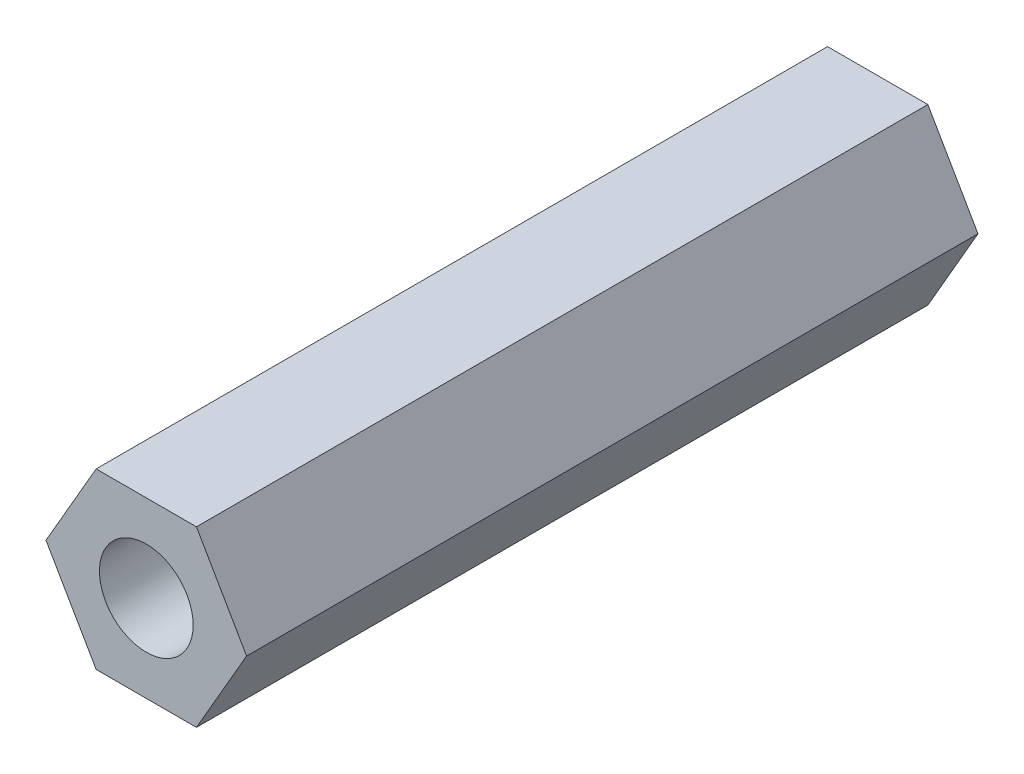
ISO-10303-21;
HEADER;
FILE_DESCRIPTION(('STEP AP214'),'2;1');
FILE_NAME('part.step','',(''),(''),'','','');
FILE_SCHEMA(('AUTOMOTIVE_DESIGN { 1 0 10303 214 1 1 1 1 }'));
ENDSEC;
DATA;
#1=APPLICATION_CONTEXT('core data for automotive mechanical design processes');
#2=APPLICATION_PROTOCOL_DEFINITION('international standard','automotive_design',2000,#1);
#3=PRODUCT_CONTEXT('',#1,'mechanical');
#4=PRODUCT('Part','Part','',(#3));
#5=PRODUCT_RELATED_PRODUCT_CATEGORY('part','',(#4));
#6=PRODUCT_DEFINITION_FORMATION('','',#4);
#7=PRODUCT_DEFINITION_CONTEXT('part definition',#1,'design');
#8=PRODUCT_DEFINITION('design','',#6,#7);
#9=PRODUCT_DEFINITION_SHAPE('','',#8);
#10=(LENGTH_UNIT() NAMED_UNIT(*) SI_UNIT(.MILLI.,.METRE.));
#11=(NAMED_UNIT(*) PLANE_ANGLE_UNIT() SI_UNIT($,.RADIAN.));
#12=(NAMED_UNIT(*) SI_UNIT($,.STERADIAN.) SOLID_ANGLE_UNIT());
#13=UNCERTAINTY_MEASURE_WITH_UNIT(LENGTH_MEASURE(1.E-05),#10,'distance_accuracy_value','');
#14=(GEOMETRIC_REPRESENTATION_CONTEXT(3) GLOBAL_UNCERTAINTY_ASSIGNED_CONTEXT((#13)) GLOBAL_UNIT_ASSIGNED_CONTEXT((#10,
#11,#12)) REPRESENTATION_CONTEXT('',''));
#15=CARTESIAN_POINT('',(0.,0.,0.));
#16=DIRECTION('',(0.,0.,1.));
#17=DIRECTION('',(1.,0.,0.));
#18=AXIS2_PLACEMENT_3D('',#15,#16,#17);
#19=CARTESIAN_POINT('',(-5.48482755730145,-9.49999999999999,80.));
#20=DIRECTION('',(0.,0.,-1.));
#21=DIRECTION('',(-1.,0.,0.));
#22=AXIS2_PLACEMENT_3D('',#19,#20,#21);
#23=PLANE('',#22);
#24=DIRECTION('',(1.,0.,0.));
#25=VECTOR('',#24,1.);
#26=CARTESIAN_POINT('',(-5.48482755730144,-9.49999999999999,80.));
#27=LINE('',#26,#25);
#28=CARTESIAN_POINT('',(-5.48482755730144,-9.49999999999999,80.));
#29=VERTEX_POINT('',#28);
#30=CARTESIAN_POINT('',(5.48482755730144,-9.49999999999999,80.));
#31=VERTEX_POINT('',#30);
#32=EDGE_CURVE('E112',#29,#31,#27,.T.);
#33=ORIENTED_EDGE('',*,*,#32,.T.);
#34=DIRECTION('',(0.5,0.866025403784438,0.));
#35=VECTOR('',#34,1.);
#36=CARTESIAN_POINT('',(5.48482755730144,-9.49999999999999,80.));
#37=LINE('',#36,#35);
#38=CARTESIAN_POINT('',(10.9696551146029,0.,80.));
#39=VERTEX_POINT('',#38);
#40=EDGE_CURVE('E93',#31,#39,#37,.T.);
#41=ORIENTED_EDGE('',*,*,#40,.T.);
#42=DIRECTION('',(-0.5,0.866025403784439,0.));
#43=VECTOR('',#42,1.);
#44=CARTESIAN_POINT('',(10.9696551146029,0.,80.));
#45=LINE('',#44,#43);
#46=CARTESIAN_POINT('',(5.48482755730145,9.49999999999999,80.));
#47=VERTEX_POINT('',#46);
#48=EDGE_CURVE('E115',#39,#47,#45,.T.);
#49=ORIENTED_EDGE('',*,*,#48,.T.);
#50=DIRECTION('',(-1.,0.,0.));
#51=VECTOR('',#50,1.);
#52=CARTESIAN_POINT('',(5.48482755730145,9.49999999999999,80.));
#53=LINE('',#52,#51);
#54=CARTESIAN_POINT('',(-5.48482755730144,9.49999999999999,80.));
#55=VERTEX_POINT('',#54);
#56=EDGE_CURVE('E117',#47,#55,#53,.T.);
#57=ORIENTED_EDGE('',*,*,#56,.T.);
#58=DIRECTION('',(-0.5,-0.866025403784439,0.));
#59=VECTOR('',#58,1.);
#60=CARTESIAN_POINT('',(-5.48482755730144,9.49999999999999,80.));
#61=LINE('',#60,#59);
#62=CARTESIAN_POINT('',(-10.9696551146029,0.,80.));
#63=VERTEX_POINT('',#62);
#64=EDGE_CURVE('E46',#55,#63,#61,.T.);
#65=ORIENTED_EDGE('',*,*,#64,.T.);
#66=DIRECTION('',(0.5,-0.866025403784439,0.));
#67=VECTOR('',#66,1.);
#68=CARTESIAN_POINT('',(-10.9696551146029,0.,80.));
#69=LINE('',#68,#67);
#70=EDGE_CURVE('E41',#63,#29,#69,.T.);
#71=ORIENTED_EDGE('',*,*,#70,.T.);
#72=EDGE_LOOP('',(#33,#41,#49,#57,#65,#71));
#73=FACE_BOUND('',#72,.T.);
#74=CARTESIAN_POINT('',(0.,0.,80.));
#75=DIRECTION('',(0.,0.,1.));
#76=DIRECTION('',(1.,0.,0.));
#77=AXIS2_PLACEMENT_3D('',#74,#75,#76);
#78=CIRCLE('',#77,5.125);
#79=CARTESIAN_POINT('',(5.125,0.,80.));
#80=VERTEX_POINT('',#79);
#81=EDGE_CURVE('E98',#80,#80,#78,.T.);
#82=ORIENTED_EDGE('',*,*,#81,.F.);
#83=EDGE_LOOP('',(#82));
#84=FACE_BOUND('',#83,.T.);
#85=ADVANCED_FACE('F26',(#73,#84),#23,.F.);
#86=CARTESIAN_POINT('',(-5.48482755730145,-9.49999999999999,0.));
#87=DIRECTION('',(0.,0.,-1.));
#88=DIRECTION('',(-1.,0.,0.));
#89=AXIS2_PLACEMENT_3D('',#86,#87,#88);
#90=PLANE('',#89);
#91=DIRECTION('',(1.,0.,0.));
#92=VECTOR('',#91,1.);
#93=CARTESIAN_POINT('',(-5.48482755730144,-9.49999999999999,0.));
#94=LINE('',#93,#92);
#95=CARTESIAN_POINT('',(-5.48482755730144,-9.49999999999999,0.));
#96=VERTEX_POINT('',#95);
#97=CARTESIAN_POINT('',(5.48482755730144,-9.49999999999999,0.));
#98=VERTEX_POINT('',#97);
#99=EDGE_CURVE('E84',#96,#98,#94,.T.);
#100=ORIENTED_EDGE('',*,*,#99,.F.);
#101=DIRECTION('',(0.5,-0.866025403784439,0.));
#102=VECTOR('',#101,1.);
#103=CARTESIAN_POINT('',(-10.9696551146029,0.,0.));
#104=LINE('',#103,#102);
#105=CARTESIAN_POINT('',(-10.9696551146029,0.,0.));
#106=VERTEX_POINT('',#105);
#107=EDGE_CURVE('E110',#106,#96,#104,.T.);
#108=ORIENTED_EDGE('',*,*,#107,.F.);
#109=DIRECTION('',(-0.5,-0.866025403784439,0.));
#110=VECTOR('',#109,1.);
#111=CARTESIAN_POINT('',(-5.48482755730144,9.49999999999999,0.));
#112=LINE('',#111,#110);
#113=CARTESIAN_POINT('',(-5.48482755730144,9.49999999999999,0.));
#114=VERTEX_POINT('',#113);
#115=EDGE_CURVE('E108',#114,#106,#112,.T.);
#116=ORIENTED_EDGE('',*,*,#115,.F.);
#117=DIRECTION('',(-1.,0.,0.));
#118=VECTOR('',#117,1.);
#119=CARTESIAN_POINT('',(5.48482755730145,9.49999999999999,0.));
#120=LINE('',#119,#118);
#121=CARTESIAN_POINT('',(5.48482755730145,9.49999999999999,0.));
#122=VERTEX_POINT('',#121);
#123=EDGE_CURVE('E106',#122,#114,#120,.T.);
#124=ORIENTED_EDGE('',*,*,#123,.F.);
#125=DIRECTION('',(-0.5,0.866025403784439,0.));
#126=VECTOR('',#125,1.);
#127=CARTESIAN_POINT('',(10.9696551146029,0.,0.));
#128=LINE('',#127,#126);
#129=CARTESIAN_POINT('',(10.9696551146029,0.,0.));
#130=VERTEX_POINT('',#129);
#131=EDGE_CURVE('E86',#130,#122,#128,.T.);
#132=ORIENTED_EDGE('',*,*,#131,.F.);
#133=DIRECTION('',(0.5,0.866025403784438,0.));
#134=VECTOR('',#133,1.);
#135=CARTESIAN_POINT('',(5.48482755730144,-9.49999999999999,0.));
#136=LINE('',#135,#134);
#137=EDGE_CURVE('E79',#98,#130,#136,.T.);
#138=ORIENTED_EDGE('',*,*,#137,.F.);
#139=EDGE_LOOP('',(#100,#108,#116,#124,#132,#138));
#140=FACE_BOUND('',#139,.T.);
#141=CARTESIAN_POINT('',(0.,0.,0.));
#142=DIRECTION('',(0.,0.,1.));
#143=DIRECTION('',(1.,0.,0.));
#144=AXIS2_PLACEMENT_3D('',#141,#142,#143);
#145=CIRCLE('',#144,5.125);
#146=CARTESIAN_POINT('',(5.125,0.,0.));
#147=VERTEX_POINT('',#146);
#148=EDGE_CURVE('E101',#147,#147,#145,.T.);
#149=ORIENTED_EDGE('',*,*,#148,.T.);
#150=EDGE_LOOP('',(#149));
#151=FACE_BOUND('',#150,.T.);
#152=ADVANCED_FACE('F80',(#140,#151),#90,.T.);
#153=CARTESIAN_POINT('',(-5.48482755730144,-9.49999999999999,80.));
#154=DIRECTION('',(0.,1.,0.));
#155=DIRECTION('',(0.,0.,1.));
#156=AXIS2_PLACEMENT_3D('',#153,#154,#155);
#157=PLANE('',#156);
#158=ORIENTED_EDGE('',*,*,#99,.T.);
#159=DIRECTION('',(0.,0.,-1.));
#160=VECTOR('',#159,1.);
#161=CARTESIAN_POINT('',(5.48482755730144,-9.49999999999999,80.));
#162=LINE('',#161,#160);
#163=EDGE_CURVE('E11',#31,#98,#162,.T.);
#164=ORIENTED_EDGE('',*,*,#163,.F.);
#165=ORIENTED_EDGE('',*,*,#32,.F.);
#166=DIRECTION('',(0.,0.,-1.));
#167=VECTOR('',#166,1.);
#168=CARTESIAN_POINT('',(-5.48482755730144,-9.49999999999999,80.));
#169=LINE('',#168,#167);
#170=EDGE_CURVE('E97',#29,#96,#169,.T.);
#171=ORIENTED_EDGE('',*,*,#170,.T.);
#172=EDGE_LOOP('',(#158,#164,#165,#171));
#173=FACE_BOUND('',#172,.T.);
#174=ADVANCED_FACE('F28',(#173),#157,.F.);
#175=CARTESIAN_POINT('',(5.48482755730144,-9.49999999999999,80.));
#176=DIRECTION('',(-0.866025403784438,0.5,0.));
#177=DIRECTION('',(-0.5,-0.866025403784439,0.));
#178=AXIS2_PLACEMENT_3D('',#175,#176,#177);
#179=PLANE('',#178);
#180=ORIENTED_EDGE('',*,*,#137,.T.);
#181=DIRECTION('',(0.,0.,-1.));
#182=VECTOR('',#181,1.);
#183=CARTESIAN_POINT('',(10.9696551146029,0.,80.));
#184=LINE('',#183,#182);
#185=EDGE_CURVE('E34',#39,#130,#184,.T.);
#186=ORIENTED_EDGE('',*,*,#185,.F.);
#187=ORIENTED_EDGE('',*,*,#40,.F.);
#188=ORIENTED_EDGE('',*,*,#163,.T.);
#189=EDGE_LOOP('',(#180,#186,#187,#188));
#190=FACE_BOUND('',#189,.T.);
#191=ADVANCED_FACE('F92',(#190),#179,.F.);
#192=CARTESIAN_POINT('',(10.9696551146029,0.,80.));
#193=DIRECTION('',(-0.866025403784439,-0.5,0.));
#194=DIRECTION('',(0.5,-0.866025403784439,0.));
#195=AXIS2_PLACEMENT_3D('',#192,#193,#194);
#196=PLANE('',#195);
#197=ORIENTED_EDGE('',*,*,#131,.T.);
#198=DIRECTION('',(0.,0.,-1.));
#199=VECTOR('',#198,1.);
#200=CARTESIAN_POINT('',(5.48482755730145,9.49999999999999,80.));
#201=LINE('',#200,#199);
#202=EDGE_CURVE('E128',#47,#122,#201,.T.);
#203=ORIENTED_EDGE('',*,*,#202,.F.);
#204=ORIENTED_EDGE('',*,*,#48,.F.);
#205=ORIENTED_EDGE('',*,*,#185,.T.);
#206=EDGE_LOOP('',(#197,#203,#204,#205));
#207=FACE_BOUND('',#206,.T.);
#208=ADVANCED_FACE('F132',(#207),#196,.F.);
#209=CARTESIAN_POINT('',(5.48482755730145,9.49999999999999,80.));
#210=DIRECTION('',(0.,-1.,0.));
#211=DIRECTION('',(1.,0.,0.));
#212=AXIS2_PLACEMENT_3D('',#209,#210,#211);
#213=PLANE('',#212);
#214=ORIENTED_EDGE('',*,*,#123,.T.);
#215=DIRECTION('',(0.,0.,-1.));
#216=VECTOR('',#215,1.);
#217=CARTESIAN_POINT('',(-5.48482755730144,9.49999999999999,80.));
#218=LINE('',#217,#216);
#219=EDGE_CURVE('E125',#55,#114,#218,.T.);
#220=ORIENTED_EDGE('',*,*,#219,.F.);
#221=ORIENTED_EDGE('',*,*,#56,.F.);
#222=ORIENTED_EDGE('',*,*,#202,.T.);
#223=EDGE_LOOP('',(#214,#220,#221,#222));
#224=FACE_BOUND('',#223,.T.);
#225=ADVANCED_FACE('F138',(#224),#213,.F.);
#226=CARTESIAN_POINT('',(-5.48482755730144,9.49999999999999,80.));
#227=DIRECTION('',(0.866025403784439,-0.5,0.));
#228=DIRECTION('',(0.5,0.866025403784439,0.));
#229=AXIS2_PLACEMENT_3D('',#226,#227,#228);
#230=PLANE('',#229);
#231=ORIENTED_EDGE('',*,*,#115,.T.);
#232=DIRECTION('',(0.,0.,-1.));
#233=VECTOR('',#232,1.);
#234=CARTESIAN_POINT('',(-10.9696551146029,0.,80.));
#235=LINE('',#234,#233);
#236=EDGE_CURVE('E122',#63,#106,#235,.T.);
#237=ORIENTED_EDGE('',*,*,#236,.F.);
#238=ORIENTED_EDGE('',*,*,#64,.F.);
#239=ORIENTED_EDGE('',*,*,#219,.T.);
#240=EDGE_LOOP('',(#231,#237,#238,#239));
#241=FACE_BOUND('',#240,.T.);
#242=ADVANCED_FACE('F141',(#241),#230,.F.);
#243=CARTESIAN_POINT('',(-10.9696551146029,0.,80.));
#244=DIRECTION('',(0.866025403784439,0.5,0.));
#245=DIRECTION('',(-0.5,0.866025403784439,0.));
#246=AXIS2_PLACEMENT_3D('',#243,#244,#245);
#247=PLANE('',#246);
#248=ORIENTED_EDGE('',*,*,#107,.T.);
#249=ORIENTED_EDGE('',*,*,#170,.F.);
#250=ORIENTED_EDGE('',*,*,#70,.F.);
#251=ORIENTED_EDGE('',*,*,#236,.T.);
#252=EDGE_LOOP('',(#248,#249,#250,#251));
#253=FACE_BOUND('',#252,.T.);
#254=ADVANCED_FACE('F143',(#253),#247,.F.);
#255=CARTESIAN_POINT('',(0.,0.,80.));
#256=DIRECTION('',(0.,0.,-1.));
#257=DIRECTION('',(-1.,0.,0.));
#258=AXIS2_PLACEMENT_3D('',#255,#256,#257);
#259=CYLINDRICAL_SURFACE('',#258,5.125);
#260=ORIENTED_EDGE('',*,*,#81,.T.);
#261=EDGE_LOOP('',(#260));
#262=FACE_BOUND('',#261,.T.);
#263=ORIENTED_EDGE('',*,*,#148,.F.);
#264=EDGE_LOOP('',(#263));
#265=FACE_BOUND('',#264,.T.);
#266=ADVANCED_FACE('F145',(#262,#265),#259,.F.);
#267=CLOSED_SHELL('',(#85,#152,#174,#191,#208,#225,#242,#254,#266));
#268=MANIFOLD_SOLID_BREP('B2',#267);
#269=ADVANCED_BREP_SHAPE_REPRESENTATION('',(#18,#268),#14);
#270=SHAPE_DEFINITION_REPRESENTATION(#9,#269);
ENDSEC;
END-ISO-10303-21;
